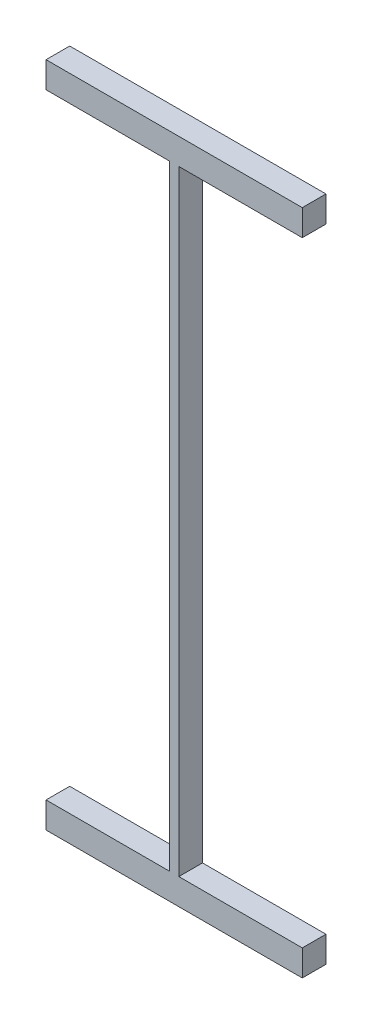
from build123d import *

# Parameters (mm, degrees)
BASESECTION_DEPTH = 12.7


with BuildPart() as part:
    # Sketch1 → BaseSection (new, symmetric)
    with BuildSketch(Plane.XY):
        Polygon((-137.5, -330), (-137.5, -358), (137.5, -358), (137.5, -330), (5, -330), (5, 330), (137.5, 330), (137.5, 358), (-137.5, 358), (-137.5, 330), (-5, 330), (-5, -330), align=None)
    extrude(amount=BASESECTION_DEPTH, both=True)


solid = part.part
